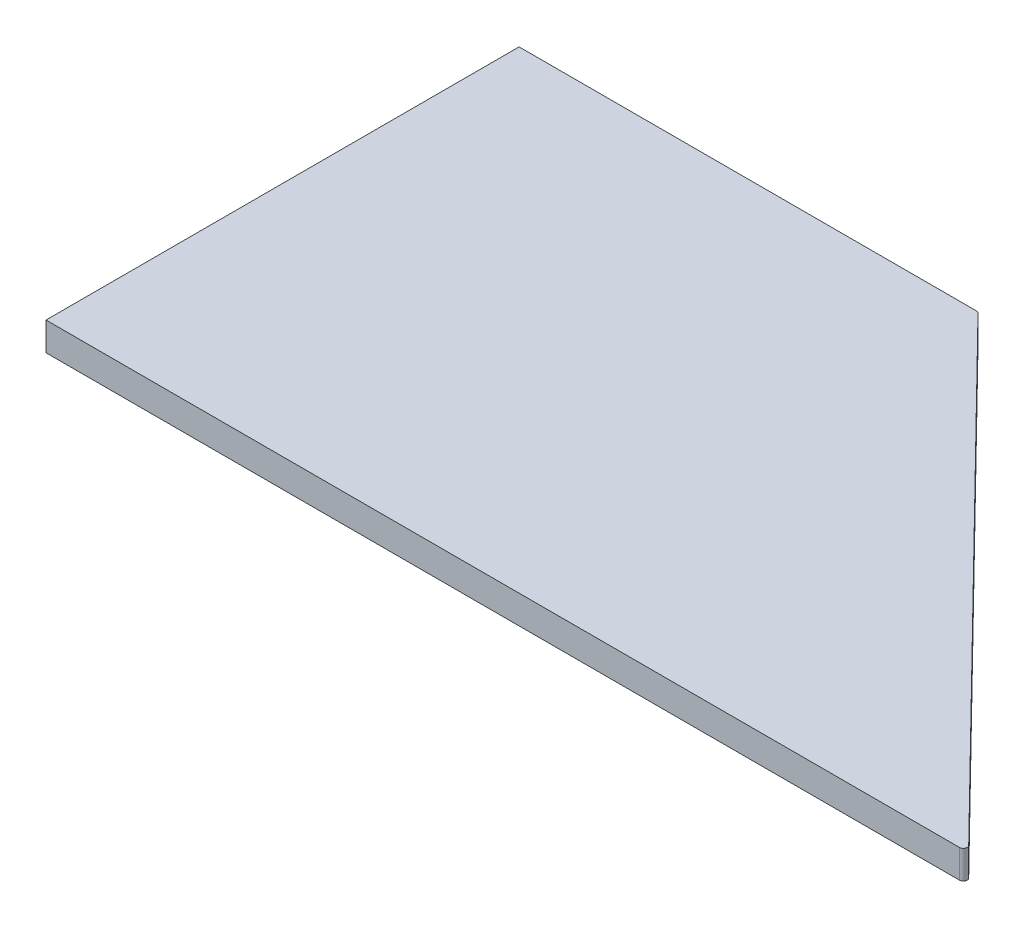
from build123d import *

# Parameters (mm, degrees)
ESTRUSIONE_ESTRUSIONE1_DEPTH = 30
RACCORDO2_R                  = 4
RACCORDO3_R                  = 4


with BuildPart() as part:
    # Schizzo1 → Estrusione-Estrusione1 (new body)
    with BuildSketch(Plane(origin=(0, 0, 0), x_dir=(1, 0, 0), z_dir=(0, 1, 0))):
        Polygon((208.396226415, -265), (698.396226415, -265), (208.396226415, 235), (-276.603773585, 235), (-276.603773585, -265), align=None)
    extrude(amount=ESTRUSIONE_ESTRUSIONE1_DEPTH)

    # Raccordo2
    raccordo2_edges = [part.edges().sort_by_distance(p)[0] for p in [
        (698.396226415, 15, 265),
    ]]
    fillet(raccordo2_edges, radius=RACCORDO2_R)

    # Raccordo3
    raccordo3_edges = [part.edges().sort_by_distance(p)[0] for p in [
        (208.396226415, 15, -235),
    ]]
    fillet(raccordo3_edges, radius=RACCORDO3_R)


solid = part.part
